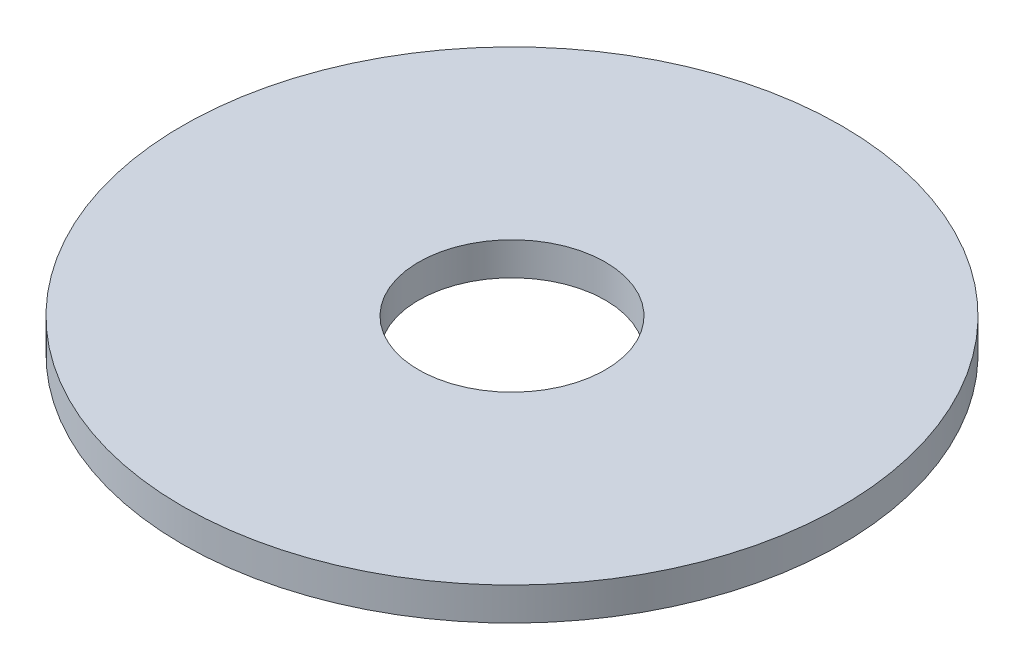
from build123d import *

# Parameters (mm, degrees)
ESQUISSE1_W = 10.75
ESQUISSE1_H = 1.5


with BuildPart() as part:
    # Esquisse1 → Base-R_volution (revolve)
    with BuildSketch(Plane.XY, mode=Mode.PRIVATE) as base_r_volution_sk:
        with Locations((9.625, 0.75)):
            Rectangle(ESQUISSE1_W, ESQUISSE1_H)
    revolve(base_r_volution_sk.sketch.rotate(Axis((0, 0, 0), (0, 1, 0)), 90), axis=Axis((0, 0, 0), (0, 1, 0)))


solid = part.part
